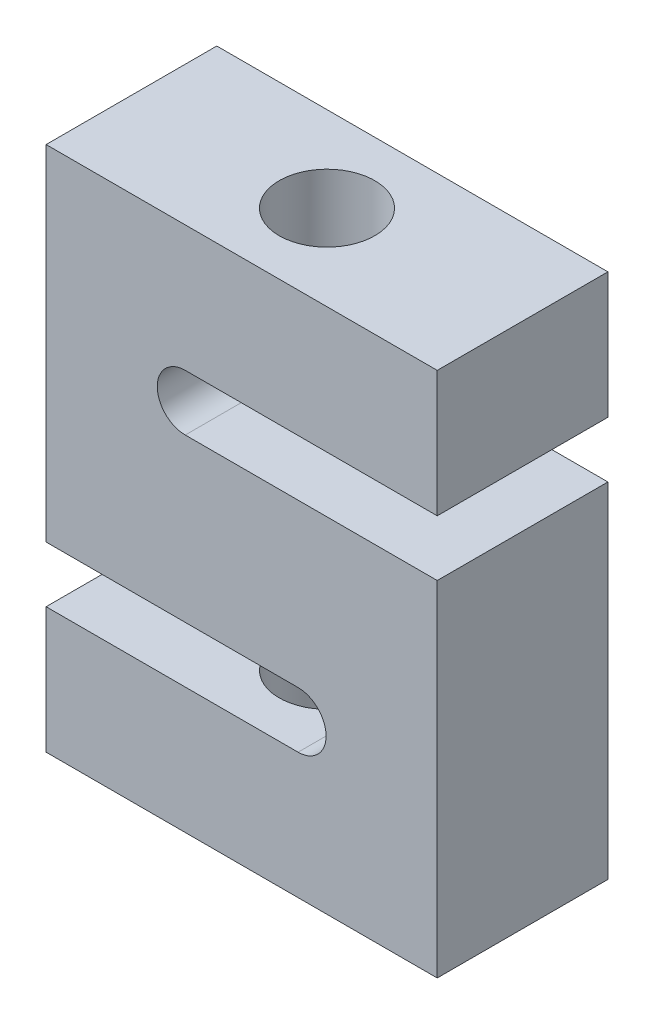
ISO-10303-21;
HEADER;
FILE_DESCRIPTION(('STEP AP214'),'2;1');
FILE_NAME('part.step','',(''),(''),'','','');
FILE_SCHEMA(('AUTOMOTIVE_DESIGN { 1 0 10303 214 1 1 1 1 }'));
ENDSEC;
DATA;
#1=APPLICATION_CONTEXT('core data for automotive mechanical design processes');
#2=APPLICATION_PROTOCOL_DEFINITION('international standard','automotive_design',2000,#1);
#3=PRODUCT_CONTEXT('',#1,'mechanical');
#4=PRODUCT('Part','Part','',(#3));
#5=PRODUCT_RELATED_PRODUCT_CATEGORY('part','',(#4));
#6=PRODUCT_DEFINITION_FORMATION('','',#4);
#7=PRODUCT_DEFINITION_CONTEXT('part definition',#1,'design');
#8=PRODUCT_DEFINITION('design','',#6,#7);
#9=PRODUCT_DEFINITION_SHAPE('','',#8);
#10=(LENGTH_UNIT() NAMED_UNIT(*) SI_UNIT(.MILLI.,.METRE.));
#11=(NAMED_UNIT(*) PLANE_ANGLE_UNIT() SI_UNIT($,.RADIAN.));
#12=(NAMED_UNIT(*) SI_UNIT($,.STERADIAN.) SOLID_ANGLE_UNIT());
#13=UNCERTAINTY_MEASURE_WITH_UNIT(LENGTH_MEASURE(1.E-05),#10,'distance_accuracy_value','');
#14=(GEOMETRIC_REPRESENTATION_CONTEXT(3) GLOBAL_UNCERTAINTY_ASSIGNED_CONTEXT((#13)) GLOBAL_UNIT_ASSIGNED_CONTEXT((#10,
#11,#12)) REPRESENTATION_CONTEXT('',''));
#15=CARTESIAN_POINT('',(0.,0.,0.));
#16=DIRECTION('',(0.,0.,1.));
#17=DIRECTION('',(1.,0.,0.));
#18=AXIS2_PLACEMENT_3D('',#15,#16,#17);
#19=CARTESIAN_POINT('',(69.85,28.98,30.48));
#20=DIRECTION('',(-1.,0.,0.));
#21=DIRECTION('',(0.,0.,1.));
#22=AXIS2_PLACEMENT_3D('',#19,#20,#21);
#23=PLANE('',#22);
#24=DIRECTION('',(0.,1.,0.));
#25=VECTOR('',#24,1.);
#26=CARTESIAN_POINT('',(69.85,28.98,-30.48));
#27=LINE('',#26,#25);
#28=CARTESIAN_POINT('',(69.85,-93.98,-30.48));
#29=VERTEX_POINT('',#28);
#30=CARTESIAN_POINT('',(69.85,28.98,-30.48));
#31=VERTEX_POINT('',#30);
#32=EDGE_CURVE('E155',#29,#31,#27,.T.);
#33=ORIENTED_EDGE('',*,*,#32,.T.);
#34=DIRECTION('',(0.,0.,-1.));
#35=VECTOR('',#34,1.);
#36=CARTESIAN_POINT('',(69.85,28.98,30.48));
#37=LINE('',#36,#35);
#38=CARTESIAN_POINT('',(69.85,28.98,30.48));
#39=VERTEX_POINT('',#38);
#40=EDGE_CURVE('E11',#39,#31,#37,.T.);
#41=ORIENTED_EDGE('',*,*,#40,.F.);
#42=DIRECTION('',(0.,1.,0.));
#43=VECTOR('',#42,1.);
#44=CARTESIAN_POINT('',(69.85,28.98,30.48));
#45=LINE('',#44,#43);
#46=CARTESIAN_POINT('',(69.85,-93.98,30.48));
#47=VERTEX_POINT('',#46);
#48=EDGE_CURVE('E178',#47,#39,#45,.T.);
#49=ORIENTED_EDGE('',*,*,#48,.F.);
#50=DIRECTION('',(0.,0.,-1.));
#51=VECTOR('',#50,1.);
#52=CARTESIAN_POINT('',(69.85,-93.98,30.48));
#53=LINE('',#52,#51);
#54=EDGE_CURVE('E151',#47,#29,#53,.T.);
#55=ORIENTED_EDGE('',*,*,#54,.T.);
#56=EDGE_LOOP('',(#33,#41,#49,#55));
#57=FACE_BOUND('',#56,.T.);
#58=ADVANCED_FACE('F35',(#57),#23,.F.);
#59=CARTESIAN_POINT('',(69.85,28.98,30.48));
#60=DIRECTION('',(0.,-1.,0.));
#61=DIRECTION('',(1.,0.,0.));
#62=AXIS2_PLACEMENT_3D('',#59,#60,#61);
#63=PLANE('',#62);
#64=DIRECTION('',(-1.,0.,0.));
#65=VECTOR('',#64,1.);
#66=CARTESIAN_POINT('',(69.85,28.98,-30.48));
#67=LINE('',#66,#65);
#68=CARTESIAN_POINT('',(-20.15,28.98,-30.48));
#69=VERTEX_POINT('',#68);
#70=EDGE_CURVE('E158',#31,#69,#67,.T.);
#71=ORIENTED_EDGE('',*,*,#70,.T.);
#72=DIRECTION('',(0.,0.,-1.));
#73=VECTOR('',#72,1.);
#74=CARTESIAN_POINT('',(-20.15,28.98,30.48));
#75=LINE('',#74,#73);
#76=CARTESIAN_POINT('',(-20.15,28.98,30.48));
#77=VERTEX_POINT('',#76);
#78=EDGE_CURVE('E43',#77,#69,#75,.T.);
#79=ORIENTED_EDGE('',*,*,#78,.F.);
#80=DIRECTION('',(-1.,0.,0.));
#81=VECTOR('',#80,1.);
#82=CARTESIAN_POINT('',(69.85,28.98,30.48));
#83=LINE('',#82,#81);
#84=EDGE_CURVE('E106',#39,#77,#83,.T.);
#85=ORIENTED_EDGE('',*,*,#84,.F.);
#86=ORIENTED_EDGE('',*,*,#40,.T.);
#87=EDGE_LOOP('',(#71,#79,#85,#86));
#88=FACE_BOUND('',#87,.T.);
#89=ADVANCED_FACE('F258',(#88),#63,.F.);
#90=CARTESIAN_POINT('',(-20.15,38.98,30.48));
#91=DIRECTION('',(0.,0.,-1.));
#92=DIRECTION('',(-1.,0.,0.));
#93=AXIS2_PLACEMENT_3D('',#90,#91,#92);
#94=CYLINDRICAL_SURFACE('',#93,10.);
#95=CARTESIAN_POINT('',(-20.15,38.98,-30.48));
#96=DIRECTION('',(0.,0.,-1.));
#97=DIRECTION('',(1.,0.,0.));
#98=AXIS2_PLACEMENT_3D('',#95,#96,#97);
#99=CIRCLE('',#98,10.);
#100=CARTESIAN_POINT('',(-20.15,48.98,-30.48));
#101=VERTEX_POINT('',#100);
#102=EDGE_CURVE('E161',#69,#101,#99,.T.);
#103=ORIENTED_EDGE('',*,*,#102,.T.);
#104=DIRECTION('',(0.,0.,-1.));
#105=VECTOR('',#104,1.);
#106=CARTESIAN_POINT('',(-20.15,48.98,30.48));
#107=LINE('',#106,#105);
#108=CARTESIAN_POINT('',(-20.15,48.98,30.48));
#109=VERTEX_POINT('',#108);
#110=EDGE_CURVE('E197',#109,#101,#107,.T.);
#111=ORIENTED_EDGE('',*,*,#110,.F.);
#112=CARTESIAN_POINT('',(-20.15,38.98,30.48));
#113=DIRECTION('',(0.,0.,-1.));
#114=DIRECTION('',(1.,0.,0.));
#115=AXIS2_PLACEMENT_3D('',#112,#113,#114);
#116=CIRCLE('',#115,10.);
#117=EDGE_CURVE('E205',#77,#109,#116,.T.);
#118=ORIENTED_EDGE('',*,*,#117,.F.);
#119=ORIENTED_EDGE('',*,*,#78,.T.);
#120=EDGE_LOOP('',(#103,#111,#118,#119));
#121=FACE_BOUND('',#120,.T.);
#122=ADVANCED_FACE('F203',(#121),#94,.F.);
#123=CARTESIAN_POINT('',(69.85,48.9800000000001,30.48));
#124=DIRECTION('',(0.,1.,0.));
#125=DIRECTION('',(-1.,0.,0.));
#126=AXIS2_PLACEMENT_3D('',#123,#124,#125);
#127=PLANE('',#126);
#128=CARTESIAN_POINT('',(0.,48.98,0.));
#129=DIRECTION('',(0.,1.,0.));
#130=DIRECTION('',(-1.,0.,0.));
#131=AXIS2_PLACEMENT_3D('',#128,#129,#130);
#132=CIRCLE('',#131,17.06626);
#133=CARTESIAN_POINT('',(-17.06626,48.98,0.));
#134=VERTEX_POINT('',#133);
#135=EDGE_CURVE('E159',#134,#134,#132,.T.);
#136=ORIENTED_EDGE('',*,*,#135,.T.);
#137=EDGE_LOOP('',(#136));
#138=FACE_BOUND('',#137,.T.);
#139=DIRECTION('',(1.,0.,0.));
#140=VECTOR('',#139,1.);
#141=CARTESIAN_POINT('',(69.85,48.9800000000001,-30.48));
#142=LINE('',#141,#140);
#143=CARTESIAN_POINT('',(69.85,48.9800000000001,-30.48));
#144=VERTEX_POINT('',#143);
#145=EDGE_CURVE('E163',#101,#144,#142,.T.);
#146=ORIENTED_EDGE('',*,*,#145,.T.);
#147=DIRECTION('',(0.,0.,-1.));
#148=VECTOR('',#147,1.);
#149=CARTESIAN_POINT('',(69.85,48.9800000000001,30.48));
#150=LINE('',#149,#148);
#151=CARTESIAN_POINT('',(69.85,48.9800000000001,30.48));
#152=VERTEX_POINT('',#151);
#153=EDGE_CURVE('E194',#152,#144,#150,.T.);
#154=ORIENTED_EDGE('',*,*,#153,.F.);
#155=DIRECTION('',(1.,0.,0.));
#156=VECTOR('',#155,1.);
#157=CARTESIAN_POINT('',(69.85,48.9800000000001,30.48));
#158=LINE('',#157,#156);
#159=EDGE_CURVE('E223',#109,#152,#158,.T.);
#160=ORIENTED_EDGE('',*,*,#159,.F.);
#161=ORIENTED_EDGE('',*,*,#110,.T.);
#162=EDGE_LOOP('',(#146,#154,#160,#161));
#163=FACE_BOUND('',#162,.T.);
#164=ADVANCED_FACE('F214',(#138,#163),#127,.F.);
#165=CARTESIAN_POINT('',(69.85,93.98,30.48));
#166=DIRECTION('',(-1.,0.,0.));
#167=DIRECTION('',(0.,0.,1.));
#168=AXIS2_PLACEMENT_3D('',#165,#166,#167);
#169=PLANE('',#168);
#170=DIRECTION('',(0.,1.,0.));
#171=VECTOR('',#170,1.);
#172=CARTESIAN_POINT('',(69.85,93.98,-30.48));
#173=LINE('',#172,#171);
#174=CARTESIAN_POINT('',(69.85,93.98,-30.48));
#175=VERTEX_POINT('',#174);
#176=EDGE_CURVE('E165',#144,#175,#173,.T.);
#177=ORIENTED_EDGE('',*,*,#176,.T.);
#178=DIRECTION('',(0.,0.,-1.));
#179=VECTOR('',#178,1.);
#180=CARTESIAN_POINT('',(69.85,93.98,30.48));
#181=LINE('',#180,#179);
#182=CARTESIAN_POINT('',(69.85,93.98,30.48));
#183=VERTEX_POINT('',#182);
#184=EDGE_CURVE('E191',#183,#175,#181,.T.);
#185=ORIENTED_EDGE('',*,*,#184,.F.);
#186=DIRECTION('',(0.,1.,0.));
#187=VECTOR('',#186,1.);
#188=CARTESIAN_POINT('',(69.85,93.98,30.48));
#189=LINE('',#188,#187);
#190=EDGE_CURVE('E220',#152,#183,#189,.T.);
#191=ORIENTED_EDGE('',*,*,#190,.F.);
#192=ORIENTED_EDGE('',*,*,#153,.T.);
#193=EDGE_LOOP('',(#177,#185,#191,#192));
#194=FACE_BOUND('',#193,.T.);
#195=ADVANCED_FACE('F218',(#194),#169,.F.);
#196=CARTESIAN_POINT('',(-69.85,93.98,30.48));
#197=DIRECTION('',(0.,-1.,0.));
#198=DIRECTION('',(0.,0.,-1.));
#199=AXIS2_PLACEMENT_3D('',#196,#197,#198);
#200=PLANE('',#199);
#201=CARTESIAN_POINT('',(0.,93.98,0.));
#202=DIRECTION('',(0.,1.,0.));
#203=DIRECTION('',(0.,0.,1.));
#204=AXIS2_PLACEMENT_3D('',#201,#202,#203);
#205=CIRCLE('',#204,17.06626);
#206=CARTESIAN_POINT('',(0.,93.98,17.06626));
#207=VERTEX_POINT('',#206);
#208=EDGE_CURVE('E292',#207,#207,#205,.T.);
#209=ORIENTED_EDGE('',*,*,#208,.F.);
#210=EDGE_LOOP('',(#209));
#211=FACE_BOUND('',#210,.T.);
#212=DIRECTION('',(-1.,0.,0.));
#213=VECTOR('',#212,1.);
#214=CARTESIAN_POINT('',(-69.85,93.98,-30.48));
#215=LINE('',#214,#213);
#216=CARTESIAN_POINT('',(-69.85,93.98,-30.48));
#217=VERTEX_POINT('',#216);
#218=EDGE_CURVE('E167',#175,#217,#215,.T.);
#219=ORIENTED_EDGE('',*,*,#218,.T.);
#220=DIRECTION('',(0.,0.,-1.));
#221=VECTOR('',#220,1.);
#222=CARTESIAN_POINT('',(-69.85,93.98,30.48));
#223=LINE('',#222,#221);
#224=CARTESIAN_POINT('',(-69.85,93.98,30.48));
#225=VERTEX_POINT('',#224);
#226=EDGE_CURVE('E188',#225,#217,#223,.T.);
#227=ORIENTED_EDGE('',*,*,#226,.F.);
#228=DIRECTION('',(-1.,0.,0.));
#229=VECTOR('',#228,1.);
#230=CARTESIAN_POINT('',(-69.85,93.98,30.48));
#231=LINE('',#230,#229);
#232=EDGE_CURVE('E222',#183,#225,#231,.T.);
#233=ORIENTED_EDGE('',*,*,#232,.F.);
#234=ORIENTED_EDGE('',*,*,#184,.T.);
#235=EDGE_LOOP('',(#219,#227,#233,#234));
#236=FACE_BOUND('',#235,.T.);
#237=ADVANCED_FACE('F272',(#211,#236),#200,.F.);
#238=CARTESIAN_POINT('',(-69.85,93.98,30.48));
#239=DIRECTION('',(1.,0.,0.));
#240=DIRECTION('',(0.,1.,0.));
#241=AXIS2_PLACEMENT_3D('',#238,#239,#240);
#242=PLANE('',#241);
#243=DIRECTION('',(0.,-1.,0.));
#244=VECTOR('',#243,1.);
#245=CARTESIAN_POINT('',(-69.85,93.98,-30.48));
#246=LINE('',#245,#244);
#247=CARTESIAN_POINT('',(-69.85,-28.98,-30.48));
#248=VERTEX_POINT('',#247);
#249=EDGE_CURVE('E169',#217,#248,#246,.T.);
#250=ORIENTED_EDGE('',*,*,#249,.T.);
#251=DIRECTION('',(0.,0.,-1.));
#252=VECTOR('',#251,1.);
#253=CARTESIAN_POINT('',(-69.85,-28.98,30.48));
#254=LINE('',#253,#252);
#255=CARTESIAN_POINT('',(-69.85,-28.98,30.48));
#256=VERTEX_POINT('',#255);
#257=EDGE_CURVE('E185',#256,#248,#254,.T.);
#258=ORIENTED_EDGE('',*,*,#257,.F.);
#259=DIRECTION('',(0.,-1.,0.));
#260=VECTOR('',#259,1.);
#261=CARTESIAN_POINT('',(-69.85,93.98,30.48));
#262=LINE('',#261,#260);
#263=EDGE_CURVE('E225',#225,#256,#262,.T.);
#264=ORIENTED_EDGE('',*,*,#263,.F.);
#265=ORIENTED_EDGE('',*,*,#226,.T.);
#266=EDGE_LOOP('',(#250,#258,#264,#265));
#267=FACE_BOUND('',#266,.T.);
#268=ADVANCED_FACE('F275',(#267),#242,.F.);
#269=CARTESIAN_POINT('',(-69.85,-28.98,30.48));
#270=DIRECTION('',(0.,1.,0.));
#271=DIRECTION('',(0.,0.,1.));
#272=AXIS2_PLACEMENT_3D('',#269,#270,#271);
#273=PLANE('',#272);
#274=DIRECTION('',(1.,0.,0.));
#275=VECTOR('',#274,1.);
#276=CARTESIAN_POINT('',(-69.85,-28.98,-30.48));
#277=LINE('',#276,#275);
#278=CARTESIAN_POINT('',(20.15,-28.98,-30.48));
#279=VERTEX_POINT('',#278);
#280=EDGE_CURVE('E171',#248,#279,#277,.T.);
#281=ORIENTED_EDGE('',*,*,#280,.T.);
#282=DIRECTION('',(0.,0.,-1.));
#283=VECTOR('',#282,1.);
#284=CARTESIAN_POINT('',(20.15,-28.98,30.48));
#285=LINE('',#284,#283);
#286=CARTESIAN_POINT('',(20.15,-28.98,30.48));
#287=VERTEX_POINT('',#286);
#288=EDGE_CURVE('E182',#287,#279,#285,.T.);
#289=ORIENTED_EDGE('',*,*,#288,.F.);
#290=DIRECTION('',(1.,0.,0.));
#291=VECTOR('',#290,1.);
#292=CARTESIAN_POINT('',(-69.85,-28.98,30.48));
#293=LINE('',#292,#291);
#294=EDGE_CURVE('E231',#256,#287,#293,.T.);
#295=ORIENTED_EDGE('',*,*,#294,.F.);
#296=ORIENTED_EDGE('',*,*,#257,.T.);
#297=EDGE_LOOP('',(#281,#289,#295,#296));
#298=FACE_BOUND('',#297,.T.);
#299=ADVANCED_FACE('F237',(#298),#273,.F.);
#300=CARTESIAN_POINT('',(20.15,-38.98,30.48));
#301=DIRECTION('',(0.,0.,-1.));
#302=DIRECTION('',(-1.,0.,0.));
#303=AXIS2_PLACEMENT_3D('',#300,#301,#302);
#304=CYLINDRICAL_SURFACE('',#303,9.99999999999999);
#305=CARTESIAN_POINT('',(20.15,-38.98,-30.48));
#306=DIRECTION('',(0.,0.,-1.));
#307=DIRECTION('',(1.,0.,0.));
#308=AXIS2_PLACEMENT_3D('',#305,#306,#307);
#309=CIRCLE('',#308,9.99999999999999);
#310=CARTESIAN_POINT('',(20.15,-48.98,-30.48));
#311=VERTEX_POINT('',#310);
#312=EDGE_CURVE('E173',#279,#311,#309,.T.);
#313=ORIENTED_EDGE('',*,*,#312,.T.);
#314=DIRECTION('',(0.,0.,-1.));
#315=VECTOR('',#314,1.);
#316=CARTESIAN_POINT('',(20.15,-48.98,30.48));
#317=LINE('',#316,#315);
#318=CARTESIAN_POINT('',(20.15,-48.98,30.48));
#319=VERTEX_POINT('',#318);
#320=EDGE_CURVE('E146',#319,#311,#317,.T.);
#321=ORIENTED_EDGE('',*,*,#320,.F.);
#322=CARTESIAN_POINT('',(20.15,-38.98,30.48));
#323=DIRECTION('',(0.,0.,-1.));
#324=DIRECTION('',(1.,0.,0.));
#325=AXIS2_PLACEMENT_3D('',#322,#323,#324);
#326=CIRCLE('',#325,9.99999999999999);
#327=EDGE_CURVE('E137',#287,#319,#326,.T.);
#328=ORIENTED_EDGE('',*,*,#327,.F.);
#329=ORIENTED_EDGE('',*,*,#288,.T.);
#330=EDGE_LOOP('',(#313,#321,#328,#329));
#331=FACE_BOUND('',#330,.T.);
#332=ADVANCED_FACE('F241',(#331),#304,.F.);
#333=CARTESIAN_POINT('',(20.15,-48.98,30.48));
#334=DIRECTION('',(0.,-1.,0.));
#335=DIRECTION('',(1.,0.,0.));
#336=AXIS2_PLACEMENT_3D('',#333,#334,#335);
#337=PLANE('',#336);
#338=CARTESIAN_POINT('',(0.,-48.98,0.));
#339=DIRECTION('',(0.,-1.,0.));
#340=DIRECTION('',(1.,0.,0.));
#341=AXIS2_PLACEMENT_3D('',#338,#339,#340);
#342=CIRCLE('',#341,17.06626);
#343=CARTESIAN_POINT('',(17.06626,-48.98,0.));
#344=VERTEX_POINT('',#343);
#345=EDGE_CURVE('E290',#344,#344,#342,.T.);
#346=ORIENTED_EDGE('',*,*,#345,.T.);
#347=EDGE_LOOP('',(#346));
#348=FACE_BOUND('',#347,.T.);
#349=DIRECTION('',(-1.,0.,0.));
#350=VECTOR('',#349,1.);
#351=CARTESIAN_POINT('',(20.15,-48.98,-30.48));
#352=LINE('',#351,#350);
#353=CARTESIAN_POINT('',(-69.85,-48.98,-30.48));
#354=VERTEX_POINT('',#353);
#355=EDGE_CURVE('E145',#311,#354,#352,.T.);
#356=ORIENTED_EDGE('',*,*,#355,.T.);
#357=DIRECTION('',(0.,0.,-1.));
#358=VECTOR('',#357,1.);
#359=CARTESIAN_POINT('',(-69.85,-48.98,30.48));
#360=LINE('',#359,#358);
#361=CARTESIAN_POINT('',(-69.85,-48.98,30.48));
#362=VERTEX_POINT('',#361);
#363=EDGE_CURVE('E142',#362,#354,#360,.T.);
#364=ORIENTED_EDGE('',*,*,#363,.F.);
#365=DIRECTION('',(-1.,0.,0.));
#366=VECTOR('',#365,1.);
#367=CARTESIAN_POINT('',(20.15,-48.98,30.48));
#368=LINE('',#367,#366);
#369=EDGE_CURVE('E131',#319,#362,#368,.T.);
#370=ORIENTED_EDGE('',*,*,#369,.F.);
#371=ORIENTED_EDGE('',*,*,#320,.T.);
#372=EDGE_LOOP('',(#356,#364,#370,#371));
#373=FACE_BOUND('',#372,.T.);
#374=ADVANCED_FACE('F143',(#348,#373),#337,.F.);
#375=CARTESIAN_POINT('',(-69.85,-48.98,30.48));
#376=DIRECTION('',(1.,0.,0.));
#377=DIRECTION('',(0.,1.,0.));
#378=AXIS2_PLACEMENT_3D('',#375,#376,#377);
#379=PLANE('',#378);
#380=DIRECTION('',(0.,-1.,0.));
#381=VECTOR('',#380,1.);
#382=CARTESIAN_POINT('',(-69.85,-48.98,-30.48));
#383=LINE('',#382,#381);
#384=CARTESIAN_POINT('',(-69.85,-93.98,-30.48));
#385=VERTEX_POINT('',#384);
#386=EDGE_CURVE('E92',#354,#385,#383,.T.);
#387=ORIENTED_EDGE('',*,*,#386,.T.);
#388=DIRECTION('',(0.,0.,-1.));
#389=VECTOR('',#388,1.);
#390=CARTESIAN_POINT('',(-69.85,-93.98,30.48));
#391=LINE('',#390,#389);
#392=CARTESIAN_POINT('',(-69.85,-93.98,30.48));
#393=VERTEX_POINT('',#392);
#394=EDGE_CURVE('E147',#393,#385,#391,.T.);
#395=ORIENTED_EDGE('',*,*,#394,.F.);
#396=DIRECTION('',(0.,-1.,0.));
#397=VECTOR('',#396,1.);
#398=CARTESIAN_POINT('',(-69.85,-48.98,30.48));
#399=LINE('',#398,#397);
#400=EDGE_CURVE('E135',#362,#393,#399,.T.);
#401=ORIENTED_EDGE('',*,*,#400,.F.);
#402=ORIENTED_EDGE('',*,*,#363,.T.);
#403=EDGE_LOOP('',(#387,#395,#401,#402));
#404=FACE_BOUND('',#403,.T.);
#405=ADVANCED_FACE('F149',(#404),#379,.F.);
#406=CARTESIAN_POINT('',(-69.85,-93.98,30.48));
#407=DIRECTION('',(0.,1.,0.));
#408=DIRECTION('',(0.,0.,1.));
#409=AXIS2_PLACEMENT_3D('',#406,#407,#408);
#410=PLANE('',#409);
#411=CARTESIAN_POINT('',(0.,-93.98,0.));
#412=DIRECTION('',(0.,-1.,0.));
#413=DIRECTION('',(0.,0.,-1.));
#414=AXIS2_PLACEMENT_3D('',#411,#412,#413);
#415=CIRCLE('',#414,17.06626);
#416=CARTESIAN_POINT('',(0.,-93.98,-17.06626));
#417=VERTEX_POINT('',#416);
#418=EDGE_CURVE('E293',#417,#417,#415,.T.);
#419=ORIENTED_EDGE('',*,*,#418,.F.);
#420=EDGE_LOOP('',(#419));
#421=FACE_BOUND('',#420,.T.);
#422=DIRECTION('',(1.,0.,0.));
#423=VECTOR('',#422,1.);
#424=CARTESIAN_POINT('',(-69.85,-93.98,-30.48));
#425=LINE('',#424,#423);
#426=EDGE_CURVE('E98',#385,#29,#425,.T.);
#427=ORIENTED_EDGE('',*,*,#426,.T.);
#428=ORIENTED_EDGE('',*,*,#54,.F.);
#429=DIRECTION('',(1.,0.,0.));
#430=VECTOR('',#429,1.);
#431=CARTESIAN_POINT('',(-69.85,-93.98,30.48));
#432=LINE('',#431,#430);
#433=EDGE_CURVE('E51',#393,#47,#432,.T.);
#434=ORIENTED_EDGE('',*,*,#433,.F.);
#435=ORIENTED_EDGE('',*,*,#394,.T.);
#436=EDGE_LOOP('',(#427,#428,#434,#435));
#437=FACE_BOUND('',#436,.T.);
#438=ADVANCED_FACE('F245',(#421,#437),#410,.F.);
#439=CARTESIAN_POINT('',(20.15,-38.98,30.48));
#440=DIRECTION('',(0.,0.,1.));
#441=DIRECTION('',(1.,0.,0.));
#442=AXIS2_PLACEMENT_3D('',#439,#440,#441);
#443=PLANE('',#442);
#444=ORIENTED_EDGE('',*,*,#48,.T.);
#445=ORIENTED_EDGE('',*,*,#84,.T.);
#446=ORIENTED_EDGE('',*,*,#117,.T.);
#447=ORIENTED_EDGE('',*,*,#159,.T.);
#448=ORIENTED_EDGE('',*,*,#190,.T.);
#449=ORIENTED_EDGE('',*,*,#232,.T.);
#450=ORIENTED_EDGE('',*,*,#263,.T.);
#451=ORIENTED_EDGE('',*,*,#294,.T.);
#452=ORIENTED_EDGE('',*,*,#327,.T.);
#453=ORIENTED_EDGE('',*,*,#369,.T.);
#454=ORIENTED_EDGE('',*,*,#400,.T.);
#455=ORIENTED_EDGE('',*,*,#433,.T.);
#456=EDGE_LOOP('',(#444,#445,#446,#447,#448,#449,#450,#451,#452,#453,#454,#455));
#457=FACE_BOUND('',#456,.T.);
#458=ADVANCED_FACE('F133',(#457),#443,.T.);
#459=CARTESIAN_POINT('',(20.15,-38.98,-30.48));
#460=DIRECTION('',(0.,0.,1.));
#461=DIRECTION('',(1.,0.,0.));
#462=AXIS2_PLACEMENT_3D('',#459,#460,#461);
#463=PLANE('',#462);
#464=ORIENTED_EDGE('',*,*,#32,.F.);
#465=ORIENTED_EDGE('',*,*,#426,.F.);
#466=ORIENTED_EDGE('',*,*,#386,.F.);
#467=ORIENTED_EDGE('',*,*,#355,.F.);
#468=ORIENTED_EDGE('',*,*,#312,.F.);
#469=ORIENTED_EDGE('',*,*,#280,.F.);
#470=ORIENTED_EDGE('',*,*,#249,.F.);
#471=ORIENTED_EDGE('',*,*,#218,.F.);
#472=ORIENTED_EDGE('',*,*,#176,.F.);
#473=ORIENTED_EDGE('',*,*,#145,.F.);
#474=ORIENTED_EDGE('',*,*,#102,.F.);
#475=ORIENTED_EDGE('',*,*,#70,.F.);
#476=EDGE_LOOP('',(#464,#465,#466,#467,#468,#469,#470,#471,#472,#473,#474,#475));
#477=FACE_BOUND('',#476,.T.);
#478=ADVANCED_FACE('F209',(#477),#463,.F.);
#479=CARTESIAN_POINT('',(0.,93.98,0.));
#480=DIRECTION('',(0.,1.,0.));
#481=DIRECTION('',(0.,0.,1.));
#482=AXIS2_PLACEMENT_3D('',#479,#480,#481);
#483=CYLINDRICAL_SURFACE('',#482,17.06626);
#484=ORIENTED_EDGE('',*,*,#135,.F.);
#485=EDGE_LOOP('',(#484));
#486=FACE_BOUND('',#485,.T.);
#487=ORIENTED_EDGE('',*,*,#208,.T.);
#488=EDGE_LOOP('',(#487));
#489=FACE_BOUND('',#488,.T.);
#490=ADVANCED_FACE('F305',(#486,#489),#483,.F.);
#491=CARTESIAN_POINT('',(0.,-93.98,0.));
#492=DIRECTION('',(0.,-1.,0.));
#493=DIRECTION('',(0.,0.,-1.));
#494=AXIS2_PLACEMENT_3D('',#491,#492,#493);
#495=CYLINDRICAL_SURFACE('',#494,17.06626);
#496=ORIENTED_EDGE('',*,*,#345,.F.);
#497=EDGE_LOOP('',(#496));
#498=FACE_BOUND('',#497,.T.);
#499=ORIENTED_EDGE('',*,*,#418,.T.);
#500=EDGE_LOOP('',(#499));
#501=FACE_BOUND('',#500,.T.);
#502=ADVANCED_FACE('F308',(#498,#501),#495,.F.);
#503=CLOSED_SHELL('',(#58,#89,#122,#164,#195,#237,#268,#299,#332,#374,#405,#438,#458,#478,#490,#502));
#504=MANIFOLD_SOLID_BREP('B2',#503);
#505=ADVANCED_BREP_SHAPE_REPRESENTATION('',(#18,#504),#14);
#506=SHAPE_DEFINITION_REPRESENTATION(#9,#505);
ENDSEC;
END-ISO-10303-21;
